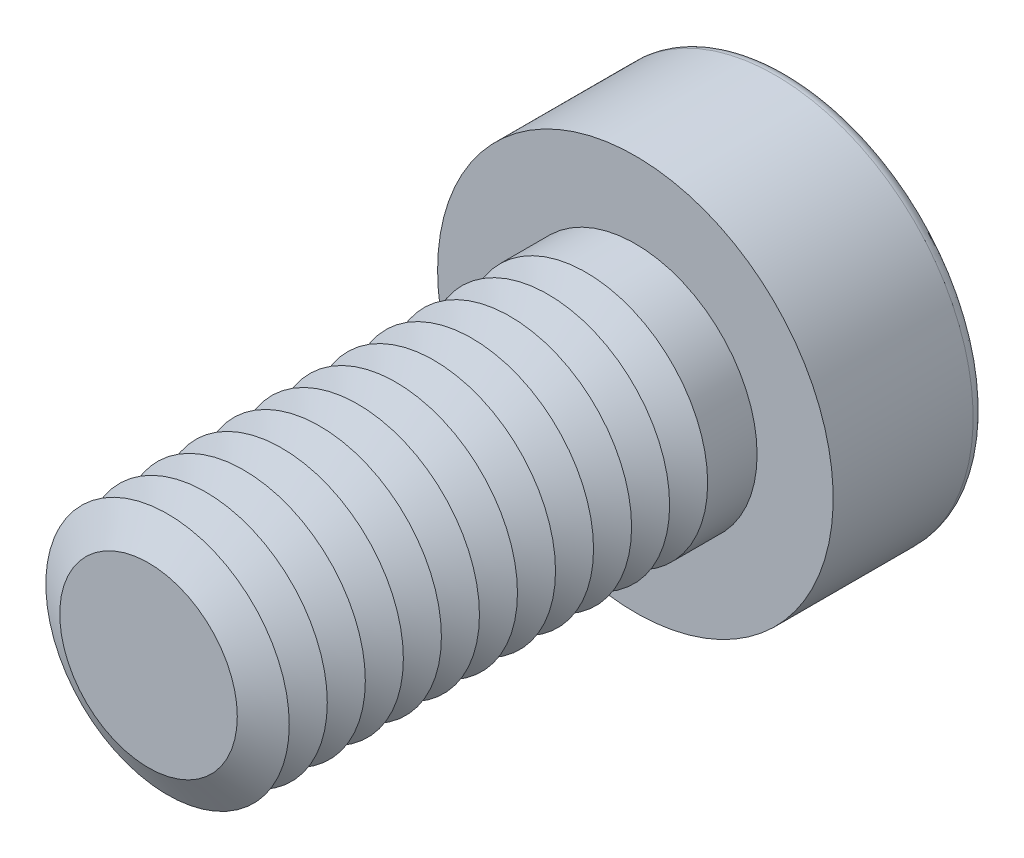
ISO-10303-21;
HEADER;
FILE_DESCRIPTION(('STEP AP214'),'2;1');
FILE_NAME('part.step','',(''),(''),'','','');
FILE_SCHEMA(('AUTOMOTIVE_DESIGN { 1 0 10303 214 1 1 1 1 }'));
ENDSEC;
DATA;
#1=APPLICATION_CONTEXT('core data for automotive mechanical design processes');
#2=APPLICATION_PROTOCOL_DEFINITION('international standard','automotive_design',2000,#1);
#3=PRODUCT_CONTEXT('',#1,'mechanical');
#4=PRODUCT('Part','Part','',(#3));
#5=PRODUCT_RELATED_PRODUCT_CATEGORY('part','',(#4));
#6=PRODUCT_DEFINITION_FORMATION('','',#4);
#7=PRODUCT_DEFINITION_CONTEXT('part definition',#1,'design');
#8=PRODUCT_DEFINITION('design','',#6,#7);
#9=PRODUCT_DEFINITION_SHAPE('','',#8);
#10=(LENGTH_UNIT() NAMED_UNIT(*) SI_UNIT(.MILLI.,.METRE.));
#11=(NAMED_UNIT(*) PLANE_ANGLE_UNIT() SI_UNIT($,.RADIAN.));
#12=(NAMED_UNIT(*) SI_UNIT($,.STERADIAN.) SOLID_ANGLE_UNIT());
#13=UNCERTAINTY_MEASURE_WITH_UNIT(LENGTH_MEASURE(1.E-05),#10,'distance_accuracy_value','');
#14=(GEOMETRIC_REPRESENTATION_CONTEXT(3) GLOBAL_UNCERTAINTY_ASSIGNED_CONTEXT((#13)) GLOBAL_UNIT_ASSIGNED_CONTEXT((#10,
#11,#12)) REPRESENTATION_CONTEXT('',''));
#15=CARTESIAN_POINT('',(0.,0.,0.));
#16=DIRECTION('',(0.,0.,1.));
#17=DIRECTION('',(1.,0.,0.));
#18=AXIS2_PLACEMENT_3D('',#15,#16,#17);
#19=CARTESIAN_POINT('',(0.,0.,11.625));
#20=DIRECTION('',(0.,0.,1.));
#21=DIRECTION('',(1.,0.,0.));
#22=AXIS2_PLACEMENT_3D('',#19,#20,#21);
#23=CONICAL_SURFACE('',#22,4.,1.0471975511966);
#24=CARTESIAN_POINT('',(0.,0.,11.));
#25=DIRECTION('',(0.,0.,1.));
#26=DIRECTION('',(1.,0.,0.));
#27=AXIS2_PLACEMENT_3D('',#24,#25,#26);
#28=CIRCLE('',#27,2.91746824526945);
#29=CARTESIAN_POINT('',(2.91746824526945,0.,11.));
#30=VERTEX_POINT('',#29);
#31=EDGE_CURVE('E313',#30,#30,#28,.T.);
#32=ORIENTED_EDGE('',*,*,#31,.T.);
#33=EDGE_LOOP('',(#32));
#34=FACE_BOUND('',#33,.T.);
#35=CARTESIAN_POINT('',(0.,0.,11.625));
#36=DIRECTION('',(0.,0.,1.));
#37=DIRECTION('',(1.,0.,0.));
#38=AXIS2_PLACEMENT_3D('',#35,#36,#37);
#39=CIRCLE('',#38,4.);
#40=CARTESIAN_POINT('',(4.,0.,11.625));
#41=VERTEX_POINT('',#40);
#42=EDGE_CURVE('E316',#41,#41,#39,.T.);
#43=ORIENTED_EDGE('',*,*,#42,.F.);
#44=EDGE_LOOP('',(#43));
#45=FACE_BOUND('',#44,.T.);
#46=ADVANCED_FACE('F39',(#34,#45),#23,.T.);
#47=CARTESIAN_POINT('',(0.,0.,11.));
#48=DIRECTION('',(0.,0.,-1.));
#49=DIRECTION('',(-1.,0.,0.));
#50=AXIS2_PLACEMENT_3D('',#47,#48,#49);
#51=CONICAL_SURFACE('',#50,2.91746824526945,1.0471975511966);
#52=CARTESIAN_POINT('',(0.,0.,10.375));
#53=DIRECTION('',(0.,0.,1.));
#54=DIRECTION('',(1.,0.,0.));
#55=AXIS2_PLACEMENT_3D('',#52,#53,#54);
#56=CIRCLE('',#55,4.);
#57=CARTESIAN_POINT('',(4.,0.,10.375));
#58=VERTEX_POINT('',#57);
#59=EDGE_CURVE('E324',#58,#58,#56,.T.);
#60=ORIENTED_EDGE('',*,*,#59,.T.);
#61=EDGE_LOOP('',(#60));
#62=FACE_BOUND('',#61,.T.);
#63=ORIENTED_EDGE('',*,*,#31,.F.);
#64=EDGE_LOOP('',(#63));
#65=FACE_BOUND('',#64,.T.);
#66=ADVANCED_FACE('F245',(#62,#65),#51,.T.);
#67=CARTESIAN_POINT('',(0.,0.,16.));
#68=DIRECTION('',(0.,0.,1.));
#69=DIRECTION('',(1.,0.,0.));
#70=AXIS2_PLACEMENT_3D('',#67,#68,#69);
#71=PLANE('',#70);
#72=CARTESIAN_POINT('',(0.,0.,16.));
#73=DIRECTION('',(0.,0.,1.));
#74=DIRECTION('',(1.,0.,0.));
#75=AXIS2_PLACEMENT_3D('',#72,#73,#74);
#76=CIRCLE('',#75,2.91746824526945);
#77=CARTESIAN_POINT('',(2.91746824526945,0.,16.));
#78=VERTEX_POINT('',#77);
#79=EDGE_CURVE('E174',#78,#78,#76,.T.);
#80=ORIENTED_EDGE('',*,*,#79,.T.);
#81=EDGE_LOOP('',(#80));
#82=FACE_BOUND('',#81,.T.);
#83=ADVANCED_FACE('F251',(#82),#71,.T.);
#84=CARTESIAN_POINT('',(0.,0.,16.));
#85=DIRECTION('',(0.,0.,-1.));
#86=DIRECTION('',(-1.,0.,0.));
#87=AXIS2_PLACEMENT_3D('',#84,#85,#86);
#88=CONICAL_SURFACE('',#87,2.91746824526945,1.0471975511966);
#89=CARTESIAN_POINT('',(0.,0.,15.375));
#90=DIRECTION('',(0.,0.,1.));
#91=DIRECTION('',(1.,0.,0.));
#92=AXIS2_PLACEMENT_3D('',#89,#90,#91);
#93=CIRCLE('',#92,4.);
#94=CARTESIAN_POINT('',(4.,0.,15.375));
#95=VERTEX_POINT('',#94);
#96=EDGE_CURVE('E291',#95,#95,#93,.T.);
#97=ORIENTED_EDGE('',*,*,#96,.T.);
#98=EDGE_LOOP('',(#97));
#99=FACE_BOUND('',#98,.T.);
#100=ORIENTED_EDGE('',*,*,#79,.F.);
#101=EDGE_LOOP('',(#100));
#102=FACE_BOUND('',#101,.T.);
#103=ADVANCED_FACE('F199',(#99,#102),#88,.T.);
#104=CARTESIAN_POINT('',(0.,0.,15.375));
#105=DIRECTION('',(0.,0.,1.));
#106=DIRECTION('',(1.,0.,0.));
#107=AXIS2_PLACEMENT_3D('',#104,#105,#106);
#108=CONICAL_SURFACE('',#107,4.,1.0471975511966);
#109=CARTESIAN_POINT('',(0.,0.,14.75));
#110=DIRECTION('',(0.,0.,1.));
#111=DIRECTION('',(1.,0.,0.));
#112=AXIS2_PLACEMENT_3D('',#109,#110,#111);
#113=CIRCLE('',#112,2.91746824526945);
#114=CARTESIAN_POINT('',(2.91746824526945,0.,14.75));
#115=VERTEX_POINT('',#114);
#116=EDGE_CURVE('E288',#115,#115,#113,.T.);
#117=ORIENTED_EDGE('',*,*,#116,.T.);
#118=EDGE_LOOP('',(#117));
#119=FACE_BOUND('',#118,.T.);
#120=ORIENTED_EDGE('',*,*,#96,.F.);
#121=EDGE_LOOP('',(#120));
#122=FACE_BOUND('',#121,.T.);
#123=ADVANCED_FACE('F277',(#119,#122),#108,.T.);
#124=CARTESIAN_POINT('',(0.,0.,14.75));
#125=DIRECTION('',(0.,0.,-1.));
#126=DIRECTION('',(-1.,0.,0.));
#127=AXIS2_PLACEMENT_3D('',#124,#125,#126);
#128=CONICAL_SURFACE('',#127,2.91746824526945,1.0471975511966);
#129=CARTESIAN_POINT('',(0.,0.,14.125));
#130=DIRECTION('',(0.,0.,1.));
#131=DIRECTION('',(1.,0.,0.));
#132=AXIS2_PLACEMENT_3D('',#129,#130,#131);
#133=CIRCLE('',#132,4.);
#134=CARTESIAN_POINT('',(4.,0.,14.125));
#135=VERTEX_POINT('',#134);
#136=EDGE_CURVE('E300',#135,#135,#133,.T.);
#137=ORIENTED_EDGE('',*,*,#136,.T.);
#138=EDGE_LOOP('',(#137));
#139=FACE_BOUND('',#138,.T.);
#140=ORIENTED_EDGE('',*,*,#116,.F.);
#141=EDGE_LOOP('',(#140));
#142=FACE_BOUND('',#141,.T.);
#143=ADVANCED_FACE('F274',(#139,#142),#128,.T.);
#144=CARTESIAN_POINT('',(0.,0.,14.125));
#145=DIRECTION('',(0.,0.,1.));
#146=DIRECTION('',(1.,0.,0.));
#147=AXIS2_PLACEMENT_3D('',#144,#145,#146);
#148=CONICAL_SURFACE('',#147,4.,1.0471975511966);
#149=CARTESIAN_POINT('',(0.,0.,13.5));
#150=DIRECTION('',(0.,0.,1.));
#151=DIRECTION('',(1.,0.,0.));
#152=AXIS2_PLACEMENT_3D('',#149,#150,#151);
#153=CIRCLE('',#152,2.91746824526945);
#154=CARTESIAN_POINT('',(2.91746824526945,0.,13.5));
#155=VERTEX_POINT('',#154);
#156=EDGE_CURVE('E293',#155,#155,#153,.T.);
#157=ORIENTED_EDGE('',*,*,#156,.T.);
#158=EDGE_LOOP('',(#157));
#159=FACE_BOUND('',#158,.T.);
#160=ORIENTED_EDGE('',*,*,#136,.F.);
#161=EDGE_LOOP('',(#160));
#162=FACE_BOUND('',#161,.T.);
#163=ADVANCED_FACE('F270',(#159,#162),#148,.T.);
#164=CARTESIAN_POINT('',(0.,0.,13.5));
#165=DIRECTION('',(0.,0.,-1.));
#166=DIRECTION('',(-1.,0.,0.));
#167=AXIS2_PLACEMENT_3D('',#164,#165,#166);
#168=CONICAL_SURFACE('',#167,2.91746824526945,1.0471975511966);
#169=CARTESIAN_POINT('',(0.,0.,12.875));
#170=DIRECTION('',(0.,0.,1.));
#171=DIRECTION('',(1.,0.,0.));
#172=AXIS2_PLACEMENT_3D('',#169,#170,#171);
#173=CIRCLE('',#172,4.);
#174=CARTESIAN_POINT('',(4.,0.,12.875));
#175=VERTEX_POINT('',#174);
#176=EDGE_CURVE('E309',#175,#175,#173,.T.);
#177=ORIENTED_EDGE('',*,*,#176,.T.);
#178=EDGE_LOOP('',(#177));
#179=FACE_BOUND('',#178,.T.);
#180=ORIENTED_EDGE('',*,*,#156,.F.);
#181=EDGE_LOOP('',(#180));
#182=FACE_BOUND('',#181,.T.);
#183=ADVANCED_FACE('F266',(#179,#182),#168,.T.);
#184=CARTESIAN_POINT('',(0.,0.,12.875));
#185=DIRECTION('',(0.,0.,1.));
#186=DIRECTION('',(1.,0.,0.));
#187=AXIS2_PLACEMENT_3D('',#184,#185,#186);
#188=CONICAL_SURFACE('',#187,4.,1.0471975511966);
#189=CARTESIAN_POINT('',(0.,0.,12.25));
#190=DIRECTION('',(0.,0.,1.));
#191=DIRECTION('',(1.,0.,0.));
#192=AXIS2_PLACEMENT_3D('',#189,#190,#191);
#193=CIRCLE('',#192,2.91746824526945);
#194=CARTESIAN_POINT('',(2.91746824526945,0.,12.25));
#195=VERTEX_POINT('',#194);
#196=EDGE_CURVE('E306',#195,#195,#193,.T.);
#197=ORIENTED_EDGE('',*,*,#196,.T.);
#198=EDGE_LOOP('',(#197));
#199=FACE_BOUND('',#198,.T.);
#200=ORIENTED_EDGE('',*,*,#176,.F.);
#201=EDGE_LOOP('',(#200));
#202=FACE_BOUND('',#201,.T.);
#203=ADVANCED_FACE('F262',(#199,#202),#188,.T.);
#204=CARTESIAN_POINT('',(0.,0.,12.25));
#205=DIRECTION('',(0.,0.,-1.));
#206=DIRECTION('',(-1.,0.,0.));
#207=AXIS2_PLACEMENT_3D('',#204,#205,#206);
#208=CONICAL_SURFACE('',#207,2.91746824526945,1.0471975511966);
#209=ORIENTED_EDGE('',*,*,#42,.T.);
#210=EDGE_LOOP('',(#209));
#211=FACE_BOUND('',#210,.T.);
#212=ORIENTED_EDGE('',*,*,#196,.F.);
#213=EDGE_LOOP('',(#212));
#214=FACE_BOUND('',#213,.T.);
#215=ADVANCED_FACE('F258',(#211,#214),#208,.T.);
#216=CARTESIAN_POINT('',(0.,0.,10.375));
#217=DIRECTION('',(0.,0.,1.));
#218=DIRECTION('',(1.,0.,0.));
#219=AXIS2_PLACEMENT_3D('',#216,#217,#218);
#220=CONICAL_SURFACE('',#219,4.,1.0471975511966);
#221=CARTESIAN_POINT('',(0.,0.,9.75));
#222=DIRECTION('',(0.,0.,1.));
#223=DIRECTION('',(1.,0.,0.));
#224=AXIS2_PLACEMENT_3D('',#221,#222,#223);
#225=CIRCLE('',#224,2.91746824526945);
#226=CARTESIAN_POINT('',(2.91746824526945,0.,9.75));
#227=VERTEX_POINT('',#226);
#228=EDGE_CURVE('E320',#227,#227,#225,.T.);
#229=ORIENTED_EDGE('',*,*,#228,.T.);
#230=EDGE_LOOP('',(#229));
#231=FACE_BOUND('',#230,.T.);
#232=ORIENTED_EDGE('',*,*,#59,.F.);
#233=EDGE_LOOP('',(#232));
#234=FACE_BOUND('',#233,.T.);
#235=ADVANCED_FACE('F261',(#231,#234),#220,.T.);
#236=CARTESIAN_POINT('',(0.,0.,9.75));
#237=DIRECTION('',(0.,0.,-1.));
#238=DIRECTION('',(-1.,0.,0.));
#239=AXIS2_PLACEMENT_3D('',#236,#237,#238);
#240=CONICAL_SURFACE('',#239,2.91746824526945,1.0471975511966);
#241=CARTESIAN_POINT('',(0.,0.,9.125));
#242=DIRECTION('',(0.,0.,1.));
#243=DIRECTION('',(1.,0.,0.));
#244=AXIS2_PLACEMENT_3D('',#241,#242,#243);
#245=CIRCLE('',#244,4.);
#246=CARTESIAN_POINT('',(4.,0.,9.125));
#247=VERTEX_POINT('',#246);
#248=EDGE_CURVE('E332',#247,#247,#245,.T.);
#249=ORIENTED_EDGE('',*,*,#248,.T.);
#250=EDGE_LOOP('',(#249));
#251=FACE_BOUND('',#250,.T.);
#252=ORIENTED_EDGE('',*,*,#228,.F.);
#253=EDGE_LOOP('',(#252));
#254=FACE_BOUND('',#253,.T.);
#255=ADVANCED_FACE('F433',(#251,#254),#240,.T.);
#256=CARTESIAN_POINT('',(0.,0.,9.125));
#257=DIRECTION('',(0.,0.,1.));
#258=DIRECTION('',(1.,0.,0.));
#259=AXIS2_PLACEMENT_3D('',#256,#257,#258);
#260=CONICAL_SURFACE('',#259,4.,1.0471975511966);
#261=CARTESIAN_POINT('',(0.,0.,8.5));
#262=DIRECTION('',(0.,0.,1.));
#263=DIRECTION('',(1.,0.,0.));
#264=AXIS2_PLACEMENT_3D('',#261,#262,#263);
#265=CIRCLE('',#264,2.91746824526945);
#266=CARTESIAN_POINT('',(2.91746824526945,0.,8.5));
#267=VERTEX_POINT('',#266);
#268=EDGE_CURVE('E328',#267,#267,#265,.T.);
#269=ORIENTED_EDGE('',*,*,#268,.T.);
#270=EDGE_LOOP('',(#269));
#271=FACE_BOUND('',#270,.T.);
#272=ORIENTED_EDGE('',*,*,#248,.F.);
#273=EDGE_LOOP('',(#272));
#274=FACE_BOUND('',#273,.T.);
#275=ADVANCED_FACE('F429',(#271,#274),#260,.T.);
#276=CARTESIAN_POINT('',(0.,0.,8.5));
#277=DIRECTION('',(0.,0.,-1.));
#278=DIRECTION('',(-1.,0.,0.));
#279=AXIS2_PLACEMENT_3D('',#276,#277,#278);
#280=CONICAL_SURFACE('',#279,2.91746824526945,1.0471975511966);
#281=CARTESIAN_POINT('',(0.,0.,7.875));
#282=DIRECTION('',(0.,0.,1.));
#283=DIRECTION('',(1.,0.,0.));
#284=AXIS2_PLACEMENT_3D('',#281,#282,#283);
#285=CIRCLE('',#284,4.);
#286=CARTESIAN_POINT('',(4.,0.,7.875));
#287=VERTEX_POINT('',#286);
#288=EDGE_CURVE('E340',#287,#287,#285,.T.);
#289=ORIENTED_EDGE('',*,*,#288,.T.);
#290=EDGE_LOOP('',(#289));
#291=FACE_BOUND('',#290,.T.);
#292=ORIENTED_EDGE('',*,*,#268,.F.);
#293=EDGE_LOOP('',(#292));
#294=FACE_BOUND('',#293,.T.);
#295=ADVANCED_FACE('F425',(#291,#294),#280,.T.);
#296=CARTESIAN_POINT('',(0.,0.,7.875));
#297=DIRECTION('',(0.,0.,1.));
#298=DIRECTION('',(1.,0.,0.));
#299=AXIS2_PLACEMENT_3D('',#296,#297,#298);
#300=CONICAL_SURFACE('',#299,4.,1.0471975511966);
#301=CARTESIAN_POINT('',(0.,0.,7.25));
#302=DIRECTION('',(0.,0.,1.));
#303=DIRECTION('',(1.,0.,0.));
#304=AXIS2_PLACEMENT_3D('',#301,#302,#303);
#305=CIRCLE('',#304,2.91746824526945);
#306=CARTESIAN_POINT('',(2.91746824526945,0.,7.25));
#307=VERTEX_POINT('',#306);
#308=EDGE_CURVE('E336',#307,#307,#305,.T.);
#309=ORIENTED_EDGE('',*,*,#308,.T.);
#310=EDGE_LOOP('',(#309));
#311=FACE_BOUND('',#310,.T.);
#312=ORIENTED_EDGE('',*,*,#288,.F.);
#313=EDGE_LOOP('',(#312));
#314=FACE_BOUND('',#313,.T.);
#315=ADVANCED_FACE('F421',(#311,#314),#300,.T.);
#316=CARTESIAN_POINT('',(0.,0.,7.25));
#317=DIRECTION('',(0.,0.,-1.));
#318=DIRECTION('',(-1.,0.,0.));
#319=AXIS2_PLACEMENT_3D('',#316,#317,#318);
#320=CONICAL_SURFACE('',#319,2.91746824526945,1.0471975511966);
#321=CARTESIAN_POINT('',(0.,0.,6.625));
#322=DIRECTION('',(0.,0.,1.));
#323=DIRECTION('',(1.,0.,0.));
#324=AXIS2_PLACEMENT_3D('',#321,#322,#323);
#325=CIRCLE('',#324,4.);
#326=CARTESIAN_POINT('',(4.,0.,6.625));
#327=VERTEX_POINT('',#326);
#328=EDGE_CURVE('E348',#327,#327,#325,.T.);
#329=ORIENTED_EDGE('',*,*,#328,.T.);
#330=EDGE_LOOP('',(#329));
#331=FACE_BOUND('',#330,.T.);
#332=ORIENTED_EDGE('',*,*,#308,.F.);
#333=EDGE_LOOP('',(#332));
#334=FACE_BOUND('',#333,.T.);
#335=ADVANCED_FACE('F417',(#331,#334),#320,.T.);
#336=CARTESIAN_POINT('',(0.,0.,6.625));
#337=DIRECTION('',(0.,0.,1.));
#338=DIRECTION('',(1.,0.,0.));
#339=AXIS2_PLACEMENT_3D('',#336,#337,#338);
#340=CONICAL_SURFACE('',#339,4.,1.0471975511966);
#341=CARTESIAN_POINT('',(0.,0.,6.));
#342=DIRECTION('',(0.,0.,1.));
#343=DIRECTION('',(1.,0.,0.));
#344=AXIS2_PLACEMENT_3D('',#341,#342,#343);
#345=CIRCLE('',#344,2.91746824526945);
#346=CARTESIAN_POINT('',(2.91746824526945,0.,6.));
#347=VERTEX_POINT('',#346);
#348=EDGE_CURVE('E344',#347,#347,#345,.T.);
#349=ORIENTED_EDGE('',*,*,#348,.T.);
#350=EDGE_LOOP('',(#349));
#351=FACE_BOUND('',#350,.T.);
#352=ORIENTED_EDGE('',*,*,#328,.F.);
#353=EDGE_LOOP('',(#352));
#354=FACE_BOUND('',#353,.T.);
#355=ADVANCED_FACE('F413',(#351,#354),#340,.T.);
#356=CARTESIAN_POINT('',(0.,0.,6.));
#357=DIRECTION('',(0.,0.,-1.));
#358=DIRECTION('',(-1.,0.,0.));
#359=AXIS2_PLACEMENT_3D('',#356,#357,#358);
#360=CONICAL_SURFACE('',#359,2.91746824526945,1.0471975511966);
#361=CARTESIAN_POINT('',(0.,0.,5.375));
#362=DIRECTION('',(0.,0.,1.));
#363=DIRECTION('',(1.,0.,0.));
#364=AXIS2_PLACEMENT_3D('',#361,#362,#363);
#365=CIRCLE('',#364,4.);
#366=CARTESIAN_POINT('',(4.,0.,5.375));
#367=VERTEX_POINT('',#366);
#368=EDGE_CURVE('E356',#367,#367,#365,.T.);
#369=ORIENTED_EDGE('',*,*,#368,.T.);
#370=EDGE_LOOP('',(#369));
#371=FACE_BOUND('',#370,.T.);
#372=ORIENTED_EDGE('',*,*,#348,.F.);
#373=EDGE_LOOP('',(#372));
#374=FACE_BOUND('',#373,.T.);
#375=ADVANCED_FACE('F409',(#371,#374),#360,.T.);
#376=CARTESIAN_POINT('',(0.,0.,5.375));
#377=DIRECTION('',(0.,0.,1.));
#378=DIRECTION('',(1.,0.,0.));
#379=AXIS2_PLACEMENT_3D('',#376,#377,#378);
#380=CONICAL_SURFACE('',#379,4.,1.0471975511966);
#381=CARTESIAN_POINT('',(0.,0.,4.75));
#382=DIRECTION('',(0.,0.,1.));
#383=DIRECTION('',(1.,0.,0.));
#384=AXIS2_PLACEMENT_3D('',#381,#382,#383);
#385=CIRCLE('',#384,2.91746824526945);
#386=CARTESIAN_POINT('',(2.91746824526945,0.,4.75));
#387=VERTEX_POINT('',#386);
#388=EDGE_CURVE('E352',#387,#387,#385,.T.);
#389=ORIENTED_EDGE('',*,*,#388,.T.);
#390=EDGE_LOOP('',(#389));
#391=FACE_BOUND('',#390,.T.);
#392=ORIENTED_EDGE('',*,*,#368,.F.);
#393=EDGE_LOOP('',(#392));
#394=FACE_BOUND('',#393,.T.);
#395=ADVANCED_FACE('F405',(#391,#394),#380,.T.);
#396=CARTESIAN_POINT('',(0.,0.,4.75));
#397=DIRECTION('',(0.,0.,-1.));
#398=DIRECTION('',(-1.,0.,0.));
#399=AXIS2_PLACEMENT_3D('',#396,#397,#398);
#400=CONICAL_SURFACE('',#399,2.91746824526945,1.0471975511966);
#401=CARTESIAN_POINT('',(0.,0.,4.125));
#402=DIRECTION('',(0.,0.,1.));
#403=DIRECTION('',(1.,0.,0.));
#404=AXIS2_PLACEMENT_3D('',#401,#402,#403);
#405=CIRCLE('',#404,4.);
#406=CARTESIAN_POINT('',(4.,0.,4.125));
#407=VERTEX_POINT('',#406);
#408=EDGE_CURVE('E364',#407,#407,#405,.T.);
#409=ORIENTED_EDGE('',*,*,#408,.T.);
#410=EDGE_LOOP('',(#409));
#411=FACE_BOUND('',#410,.T.);
#412=ORIENTED_EDGE('',*,*,#388,.F.);
#413=EDGE_LOOP('',(#412));
#414=FACE_BOUND('',#413,.T.);
#415=ADVANCED_FACE('F401',(#411,#414),#400,.T.);
#416=CARTESIAN_POINT('',(0.,0.,4.125));
#417=DIRECTION('',(0.,0.,1.));
#418=DIRECTION('',(1.,0.,0.));
#419=AXIS2_PLACEMENT_3D('',#416,#417,#418);
#420=CONICAL_SURFACE('',#419,4.,1.0471975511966);
#421=CARTESIAN_POINT('',(0.,0.,3.5));
#422=DIRECTION('',(0.,0.,1.));
#423=DIRECTION('',(1.,0.,0.));
#424=AXIS2_PLACEMENT_3D('',#421,#422,#423);
#425=CIRCLE('',#424,2.91746824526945);
#426=CARTESIAN_POINT('',(2.91746824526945,0.,3.5));
#427=VERTEX_POINT('',#426);
#428=EDGE_CURVE('E360',#427,#427,#425,.T.);
#429=ORIENTED_EDGE('',*,*,#428,.T.);
#430=EDGE_LOOP('',(#429));
#431=FACE_BOUND('',#430,.T.);
#432=ORIENTED_EDGE('',*,*,#408,.F.);
#433=EDGE_LOOP('',(#432));
#434=FACE_BOUND('',#433,.T.);
#435=ADVANCED_FACE('F396',(#431,#434),#420,.T.);
#436=CARTESIAN_POINT('',(0.,0.,3.5));
#437=DIRECTION('',(0.,0.,-1.));
#438=DIRECTION('',(-1.,0.,0.));
#439=AXIS2_PLACEMENT_3D('',#436,#437,#438);
#440=CONICAL_SURFACE('',#439,2.91746824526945,1.0471975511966);
#441=CARTESIAN_POINT('',(0.,0.,2.875));
#442=DIRECTION('',(0.,0.,1.));
#443=DIRECTION('',(1.,0.,0.));
#444=AXIS2_PLACEMENT_3D('',#441,#442,#443);
#445=CIRCLE('',#444,4.);
#446=CARTESIAN_POINT('',(4.,0.,2.875));
#447=VERTEX_POINT('',#446);
#448=EDGE_CURVE('E376',#447,#447,#445,.T.);
#449=ORIENTED_EDGE('',*,*,#448,.T.);
#450=EDGE_LOOP('',(#449));
#451=FACE_BOUND('',#450,.T.);
#452=ORIENTED_EDGE('',*,*,#428,.F.);
#453=EDGE_LOOP('',(#452));
#454=FACE_BOUND('',#453,.T.);
#455=ADVANCED_FACE('F382',(#451,#454),#440,.T.);
#456=CARTESIAN_POINT('',(0.,0.,2.875));
#457=DIRECTION('',(0.,0.,1.));
#458=DIRECTION('',(1.,0.,0.));
#459=AXIS2_PLACEMENT_3D('',#456,#457,#458);
#460=CONICAL_SURFACE('',#459,4.,1.0471975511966);
#461=CARTESIAN_POINT('',(0.,0.,2.25));
#462=DIRECTION('',(0.,0.,1.));
#463=DIRECTION('',(1.,0.,0.));
#464=AXIS2_PLACEMENT_3D('',#461,#462,#463);
#465=CIRCLE('',#464,2.91746824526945);
#466=CARTESIAN_POINT('',(2.91746824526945,0.,2.25));
#467=VERTEX_POINT('',#466);
#468=EDGE_CURVE('E368',#467,#467,#465,.T.);
#469=ORIENTED_EDGE('',*,*,#468,.T.);
#470=EDGE_LOOP('',(#469));
#471=FACE_BOUND('',#470,.T.);
#472=ORIENTED_EDGE('',*,*,#448,.F.);
#473=EDGE_LOOP('',(#472));
#474=FACE_BOUND('',#473,.T.);
#475=ADVANCED_FACE('F385',(#471,#474),#460,.T.);
#476=CARTESIAN_POINT('',(0.,0.,2.25));
#477=DIRECTION('',(0.,0.,-1.));
#478=DIRECTION('',(-1.,0.,0.));
#479=AXIS2_PLACEMENT_3D('',#476,#477,#478);
#480=CONICAL_SURFACE('',#479,2.91746824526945,1.0471975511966);
#481=CARTESIAN_POINT('',(0.,0.,1.625));
#482=DIRECTION('',(0.,0.,1.));
#483=DIRECTION('',(1.,0.,0.));
#484=AXIS2_PLACEMENT_3D('',#481,#482,#483);
#485=CIRCLE('',#484,4.);
#486=CARTESIAN_POINT('',(4.,0.,1.625));
#487=VERTEX_POINT('',#486);
#488=EDGE_CURVE('E372',#487,#487,#485,.T.);
#489=ORIENTED_EDGE('',*,*,#488,.T.);
#490=EDGE_LOOP('',(#489));
#491=FACE_BOUND('',#490,.T.);
#492=ORIENTED_EDGE('',*,*,#468,.F.);
#493=EDGE_LOOP('',(#492));
#494=FACE_BOUND('',#493,.T.);
#495=ADVANCED_FACE('F387',(#491,#494),#480,.T.);
#496=CARTESIAN_POINT('',(0.,0.,-1.25));
#497=DIRECTION('',(0.,0.,-1.));
#498=DIRECTION('',(-1.,0.,0.));
#499=AXIS2_PLACEMENT_3D('',#496,#497,#498);
#500=CONICAL_SURFACE('',#499,2.5,1.0471975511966);
#501=CARTESIAN_POINT('',(0.,0.,0.193375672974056));
#502=VERTEX_POINT('',#501);
#503=VERTEX_LOOP('',#502);
#504=FACE_BOUND('',#503,.T.);
#505=CARTESIAN_POINT('',(0.,0.,-1.25));
#506=DIRECTION('',(0.,0.,-1.));
#507=DIRECTION('',(-1.,0.,0.));
#508=AXIS2_PLACEMENT_3D('',#505,#506,#507);
#509=CIRCLE('',#508,2.5);
#510=CARTESIAN_POINT('',(-2.1650635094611,1.25,-1.25));
#511=VERTEX_POINT('',#510);
#512=CARTESIAN_POINT('',(0.,2.5,-1.25));
#513=VERTEX_POINT('',#512);
#514=EDGE_CURVE('E149',#511,#513,#509,.T.);
#515=ORIENTED_EDGE('',*,*,#514,.T.);
#516=CARTESIAN_POINT('',(0.,0.,-1.25));
#517=DIRECTION('',(0.,0.,-1.));
#518=DIRECTION('',(-1.,0.,0.));
#519=AXIS2_PLACEMENT_3D('',#516,#517,#518);
#520=CIRCLE('',#519,2.5);
#521=CARTESIAN_POINT('',(2.1650635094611,1.25,-1.25));
#522=VERTEX_POINT('',#521);
#523=EDGE_CURVE('E54',#513,#522,#520,.T.);
#524=ORIENTED_EDGE('',*,*,#523,.T.);
#525=CARTESIAN_POINT('',(2.1650635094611,-1.25,-1.25));
#526=VERTEX_POINT('',#525);
#527=EDGE_CURVE('E880',#522,#526,#520,.T.);
#528=ORIENTED_EDGE('',*,*,#527,.T.);
#529=CARTESIAN_POINT('',(0.,-2.5,-1.25));
#530=VERTEX_POINT('',#529);
#531=EDGE_CURVE('E878',#526,#530,#520,.T.);
#532=ORIENTED_EDGE('',*,*,#531,.T.);
#533=CARTESIAN_POINT('',(-2.1650635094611,-1.25,-1.25));
#534=VERTEX_POINT('',#533);
#535=EDGE_CURVE('E872',#530,#534,#520,.T.);
#536=ORIENTED_EDGE('',*,*,#535,.T.);
#537=EDGE_CURVE('E870',#534,#511,#520,.T.);
#538=ORIENTED_EDGE('',*,*,#537,.T.);
#539=EDGE_LOOP('',(#515,#524,#528,#532,#536,#538));
#540=FACE_BOUND('',#539,.T.);
#541=ADVANCED_FACE('F201',(#504,#540),#500,.F.);
#542=CARTESIAN_POINT('',(0.,0.,-1.25));
#543=DIRECTION('',(0.,0.,-1.));
#544=DIRECTION('',(-1.,0.,0.));
#545=AXIS2_PLACEMENT_3D('',#542,#543,#544);
#546=PLANE('',#545);
#547=ORIENTED_EDGE('',*,*,#523,.F.);
#548=DIRECTION('',(1.,0.,0.));
#549=VECTOR('',#548,1.);
#550=CARTESIAN_POINT('',(-1.44337567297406,2.5,-1.25));
#551=LINE('',#550,#549);
#552=CARTESIAN_POINT('',(1.44337567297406,2.5,-1.25));
#553=VERTEX_POINT('',#552);
#554=EDGE_CURVE('E917',#513,#553,#551,.T.);
#555=ORIENTED_EDGE('',*,*,#554,.T.);
#556=DIRECTION('',(0.5,-0.866025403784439,0.));
#557=VECTOR('',#556,1.);
#558=CARTESIAN_POINT('',(1.44337567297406,2.5,-1.25));
#559=LINE('',#558,#557);
#560=EDGE_CURVE('E155',#553,#522,#559,.T.);
#561=ORIENTED_EDGE('',*,*,#560,.T.);
#562=EDGE_LOOP('',(#547,#555,#561));
#563=FACE_BOUND('',#562,.T.);
#564=ADVANCED_FACE('F498',(#563),#546,.T.);
#565=ORIENTED_EDGE('',*,*,#527,.F.);
#566=CARTESIAN_POINT('',(2.88675134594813,0.,-1.25));
#567=VERTEX_POINT('',#566);
#568=EDGE_CURVE('E919',#522,#567,#559,.T.);
#569=ORIENTED_EDGE('',*,*,#568,.T.);
#570=DIRECTION('',(-0.5,-0.866025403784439,0.));
#571=VECTOR('',#570,1.);
#572=CARTESIAN_POINT('',(2.88675134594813,0.,-1.25));
#573=LINE('',#572,#571);
#574=EDGE_CURVE('E892',#567,#526,#573,.T.);
#575=ORIENTED_EDGE('',*,*,#574,.T.);
#576=EDGE_LOOP('',(#565,#569,#575));
#577=FACE_BOUND('',#576,.T.);
#578=ADVANCED_FACE('F508',(#577),#546,.T.);
#579=ORIENTED_EDGE('',*,*,#531,.F.);
#580=CARTESIAN_POINT('',(1.44337567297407,-2.5,-1.25));
#581=VERTEX_POINT('',#580);
#582=EDGE_CURVE('E894',#526,#581,#573,.T.);
#583=ORIENTED_EDGE('',*,*,#582,.T.);
#584=DIRECTION('',(-1.,0.,0.));
#585=VECTOR('',#584,1.);
#586=CARTESIAN_POINT('',(1.44337567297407,-2.5,-1.25));
#587=LINE('',#586,#585);
#588=EDGE_CURVE('E845',#581,#530,#587,.T.);
#589=ORIENTED_EDGE('',*,*,#588,.T.);
#590=EDGE_LOOP('',(#579,#583,#589));
#591=FACE_BOUND('',#590,.T.);
#592=ADVANCED_FACE('F518',(#591),#546,.T.);
#593=ORIENTED_EDGE('',*,*,#535,.F.);
#594=CARTESIAN_POINT('',(-1.44337567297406,-2.5,-1.25));
#595=VERTEX_POINT('',#594);
#596=EDGE_CURVE('E889',#530,#595,#587,.T.);
#597=ORIENTED_EDGE('',*,*,#596,.T.);
#598=DIRECTION('',(-0.5,0.866025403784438,0.));
#599=VECTOR('',#598,1.);
#600=CARTESIAN_POINT('',(-1.44337567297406,-2.5,-1.25));
#601=LINE('',#600,#599);
#602=EDGE_CURVE('E891',#595,#534,#601,.T.);
#603=ORIENTED_EDGE('',*,*,#602,.T.);
#604=EDGE_LOOP('',(#593,#597,#603));
#605=FACE_BOUND('',#604,.T.);
#606=ADVANCED_FACE('F526',(#605),#546,.T.);
#607=ORIENTED_EDGE('',*,*,#537,.F.);
#608=CARTESIAN_POINT('',(-2.88675134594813,0.,-1.25));
#609=VERTEX_POINT('',#608);
#610=EDGE_CURVE('E896',#534,#609,#601,.T.);
#611=ORIENTED_EDGE('',*,*,#610,.T.);
#612=DIRECTION('',(0.5,0.866025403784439,0.));
#613=VECTOR('',#612,1.);
#614=CARTESIAN_POINT('',(-2.88675134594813,0.,-1.25));
#615=LINE('',#614,#613);
#616=EDGE_CURVE('E158',#609,#511,#615,.T.);
#617=ORIENTED_EDGE('',*,*,#616,.T.);
#618=EDGE_LOOP('',(#607,#611,#617));
#619=FACE_BOUND('',#618,.T.);
#620=ADVANCED_FACE('F231',(#619),#546,.T.);
#621=ORIENTED_EDGE('',*,*,#514,.F.);
#622=CARTESIAN_POINT('',(-1.44337567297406,2.5,-1.25));
#623=VERTEX_POINT('',#622);
#624=EDGE_CURVE('E903',#511,#623,#615,.T.);
#625=ORIENTED_EDGE('',*,*,#624,.T.);
#626=EDGE_CURVE('E915',#623,#513,#551,.T.);
#627=ORIENTED_EDGE('',*,*,#626,.T.);
#628=EDGE_LOOP('',(#621,#625,#627));
#629=FACE_BOUND('',#628,.T.);
#630=ADVANCED_FACE('F510',(#629),#546,.T.);
#631=CARTESIAN_POINT('',(-1.44337567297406,2.5,-1.25));
#632=DIRECTION('',(0.,1.,0.));
#633=DIRECTION('',(-1.,0.,0.));
#634=AXIS2_PLACEMENT_3D('',#631,#632,#633);
#635=PLANE('',#634);
#636=DIRECTION('',(0.,0.,-1.));
#637=VECTOR('',#636,1.);
#638=CARTESIAN_POINT('',(-1.44337567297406,2.5,-1.25));
#639=LINE('',#638,#637);
#640=CARTESIAN_POINT('',(-1.44337567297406,2.5,-5.));
#641=VERTEX_POINT('',#640);
#642=EDGE_CURVE('E147',#623,#641,#639,.T.);
#643=ORIENTED_EDGE('',*,*,#642,.T.);
#644=CARTESIAN_POINT('',(-3.76800948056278,2.5,-5.43814611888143));
#645=CARTESIAN_POINT('',(-3.65512241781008,2.5,-5.41294788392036));
#646=CARTESIAN_POINT('',(-3.54216337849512,2.5,-5.38806689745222));
#647=CARTESIAN_POINT('',(-3.31606595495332,2.5,-5.33910944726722));
#648=CARTESIAN_POINT('',(-3.202927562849,2.5,-5.31503301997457));
#649=CARTESIAN_POINT('',(-2.97632910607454,2.5,-5.26783262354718));
#650=CARTESIAN_POINT('',(-2.86286882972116,2.5,-5.24470966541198));
#651=CARTESIAN_POINT('',(-2.63570880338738,2.5,-5.19967851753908));
#652=CARTESIAN_POINT('',(-2.522009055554,2.5,-5.17777031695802));
#653=CARTESIAN_POINT('',(-2.18246936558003,2.5,-5.11464083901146));
#654=CARTESIAN_POINT('',(-1.95621666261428,2.5,-5.07559469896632));
#655=CARTESIAN_POINT('',(-1.50233128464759,2.5,-5.00642421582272));
#656=CARTESIAN_POINT('',(-1.27469889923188,2.5,-4.97629806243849));
#657=CARTESIAN_POINT('',(-0.930935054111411,2.5,-4.9407375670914));
#658=CARTESIAN_POINT('',(-0.815306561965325,2.5,-4.93045885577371));
#659=CARTESIAN_POINT('',(-0.583775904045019,2.5,-4.91374261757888));
#660=CARTESIAN_POINT('',(-0.467873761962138,2.5,-4.9073047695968));
#661=CARTESIAN_POINT('',(-0.235955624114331,2.5,-4.89864425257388));
#662=CARTESIAN_POINT('',(-0.119939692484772,2.5,-4.89641989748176));
#663=CARTESIAN_POINT('',(0.11209426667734,2.5,-4.89632233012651));
#664=CARTESIAN_POINT('',(0.228112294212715,2.5,-4.89844912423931));
#665=CARTESIAN_POINT('',(0.460464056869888,2.5,-4.90693624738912));
#666=CARTESIAN_POINT('',(0.576797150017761,2.5,-4.91331380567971));
#667=CARTESIAN_POINT('',(0.809186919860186,2.5,-4.92994602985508));
#668=CARTESIAN_POINT('',(0.925243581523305,2.5,-4.94020090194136));
#669=CARTESIAN_POINT('',(1.1570783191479,2.5,-4.96408095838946));
#670=CARTESIAN_POINT('',(1.27285617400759,2.5,-4.97770825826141));
#671=CARTESIAN_POINT('',(1.50403978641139,2.5,-5.0077859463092));
#672=CARTESIAN_POINT('',(1.61944554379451,2.5,-5.02423633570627));
#673=CARTESIAN_POINT('',(1.97116037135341,2.5,-5.07794848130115));
#674=CARTESIAN_POINT('',(2.20690405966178,2.5,-5.11889404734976));
#675=CARTESIAN_POINT('',(2.67723558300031,2.5,-5.2069642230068));
#676=CARTESIAN_POINT('',(2.9118232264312,2.5,-5.25408982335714));
#677=CARTESIAN_POINT('',(3.38022088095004,2.5,-5.35235327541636));
#678=CARTESIAN_POINT('',(3.61403064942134,2.5,-5.40349227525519));
#679=CARTESIAN_POINT('',(4.08105387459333,2.5,-5.50842823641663));
#680=CARTESIAN_POINT('',(4.31426731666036,2.5,-5.56222526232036));
#681=CARTESIAN_POINT('',(4.77742011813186,2.5,-5.67097662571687));
#682=CARTESIAN_POINT('',(5.00736469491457,2.5,-5.72590882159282));
#683=CARTESIAN_POINT('',(5.46695141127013,2.5,-5.83704335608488));
#684=CARTESIAN_POINT('',(5.69659354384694,2.5,-5.89324572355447));
#685=CARTESIAN_POINT('',(6.15532898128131,2.5,-6.00649703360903));
#686=CARTESIAN_POINT('',(6.3844226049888,2.5,-6.06354468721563));
#687=CARTESIAN_POINT('',(6.84242442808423,2.5,-6.17834514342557));
#688=CARTESIAN_POINT('',(7.07133263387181,2.5,-6.23609792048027));
#689=CARTESIAN_POINT('',(7.30017784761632,2.5,-6.29409642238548));
#690=B_SPLINE_CURVE_WITH_KNOTS('',3,(#644,#645,#646,#647,#648,#649,#650,#651,#652,#653,#654,
#655,#656,#657,#658,#659,#660,#661,#662,#663,#664,#665,#666,#667,#668,#669,#670,#671,#672,#673,
#674,#675,#676,#677,#678,#679,#680,#681,#682,#683,#684,#685,#686,#687,#688,#689),.UNSPECIFIED.,
.F.,.F.,(4,2,2,2,2,2,2,2,2,2,2,2,2,2,2,2,2,2,2,2,2,2,4),(0.,0.346996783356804,0.694009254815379,
1.04138068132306,1.38874900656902,2.07743762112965,2.76598637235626,3.11418615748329,
3.46235682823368,3.81038814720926,4.15841997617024,4.50787110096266,4.85734081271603,
5.2070303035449,5.55671994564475,6.27438533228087,6.99216591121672,7.71015258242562,
8.42815670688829,9.13739674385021,9.84665290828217,10.5549206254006,11.2631627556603),.UNSPECIFIED.);
#691=CARTESIAN_POINT('',(1.44337567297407,2.5,-5.));
#692=VERTEX_POINT('',#691);
#693=EDGE_CURVE('E124',#641,#692,#690,.T.);
#694=ORIENTED_EDGE('',*,*,#693,.T.);
#695=DIRECTION('',(0.,0.,-1.));
#696=VECTOR('',#695,1.);
#697=CARTESIAN_POINT('',(1.44337567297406,2.5,-1.25));
#698=LINE('',#697,#696);
#699=EDGE_CURVE('E143',#553,#692,#698,.T.);
#700=ORIENTED_EDGE('',*,*,#699,.F.);
#701=ORIENTED_EDGE('',*,*,#554,.F.);
#702=ORIENTED_EDGE('',*,*,#626,.F.);
#703=EDGE_LOOP('',(#643,#694,#700,#701,#702));
#704=FACE_BOUND('',#703,.T.);
#705=ADVANCED_FACE('F141',(#704),#635,.F.);
#706=CARTESIAN_POINT('',(1.44337567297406,2.5,-1.25));
#707=DIRECTION('',(0.866025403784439,0.5,0.));
#708=DIRECTION('',(-0.5,0.866025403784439,0.));
#709=AXIS2_PLACEMENT_3D('',#706,#707,#708);
#710=PLANE('',#709);
#711=ORIENTED_EDGE('',*,*,#699,.T.);
#712=CARTESIAN_POINT('',(1.44326020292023,2.5002,-5.00003094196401));
#713=CARTESIAN_POINT('',(1.50320952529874,2.3963647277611,-4.98395956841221));
#714=CARTESIAN_POINT('',(1.56326755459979,2.29234116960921,-4.96936932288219));
#715=CARTESIAN_POINT('',(1.68359574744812,2.08392662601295,-4.94373552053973));
#716=CARTESIAN_POINT('',(1.7438659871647,1.97953550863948,-4.93269340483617));
#717=CARTESIAN_POINT('',(1.86425311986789,1.77101887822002,-4.91480059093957));
#718=CARTESIAN_POINT('',(1.9243691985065,1.66689477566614,-4.90792855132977));
#719=CARTESIAN_POINT('',(2.04467803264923,1.45851376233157,-4.89871383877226));
#720=CARTESIAN_POINT('',(2.10487077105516,1.35425688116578,-4.89637028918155));
#721=CARTESIAN_POINT('',(2.22525624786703,1.14574311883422,-4.89637028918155));
#722=CARTESIAN_POINT('',(2.28544898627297,1.04148623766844,-4.89871383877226));
#723=CARTESIAN_POINT('',(2.40575782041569,0.833105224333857,-4.90792855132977));
#724=CARTESIAN_POINT('',(2.4658738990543,0.728981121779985,-4.91480059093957));
#725=CARTESIAN_POINT('',(2.58626103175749,0.520464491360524,-4.93269340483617));
#726=CARTESIAN_POINT('',(2.64653127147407,0.416073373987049,-4.94373552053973));
#727=CARTESIAN_POINT('',(2.7668594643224,0.207658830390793,-4.96936932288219));
#728=CARTESIAN_POINT('',(2.82691749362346,0.103635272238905,-4.98395956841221));
#729=CARTESIAN_POINT('',(2.88686681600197,-0.000199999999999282,-5.00003094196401));
#730=B_SPLINE_CURVE_WITH_KNOTS('',3,(#712,#713,#714,#715,#716,#717,#718,#719,#720,#721,#722,
#723,#724,#725,#726,#727,#728,#729),.UNSPECIFIED.,.F.,.F.,(4,2,2,2,2,2,2,2,4),(0.,
0.362931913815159,0.726011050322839,1.08721601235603,1.44835104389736,1.80948607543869,
2.17069103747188,2.53377017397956,2.89670208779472),.UNSPECIFIED.);
#731=CARTESIAN_POINT('',(2.88675134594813,0.,-5.));
#732=VERTEX_POINT('',#731);
#733=EDGE_CURVE('E11',#692,#732,#730,.T.);
#734=ORIENTED_EDGE('',*,*,#733,.T.);
#735=DIRECTION('',(0.,0.,-1.));
#736=VECTOR('',#735,1.);
#737=CARTESIAN_POINT('',(2.88675134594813,0.,-1.25));
#738=LINE('',#737,#736);
#739=EDGE_CURVE('E157',#567,#732,#738,.T.);
#740=ORIENTED_EDGE('',*,*,#739,.F.);
#741=ORIENTED_EDGE('',*,*,#568,.F.);
#742=ORIENTED_EDGE('',*,*,#560,.F.);
#743=EDGE_LOOP('',(#711,#734,#740,#741,#742));
#744=FACE_BOUND('',#743,.T.);
#745=ADVANCED_FACE('F152',(#744),#710,.F.);
#746=CARTESIAN_POINT('',(2.88675134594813,0.,-1.25));
#747=DIRECTION('',(0.866025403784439,-0.5,0.));
#748=DIRECTION('',(0.5,0.866025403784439,0.));
#749=AXIS2_PLACEMENT_3D('',#746,#747,#748);
#750=PLANE('',#749);
#751=ORIENTED_EDGE('',*,*,#739,.T.);
#752=CARTESIAN_POINT('',(2.88686681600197,0.000200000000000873,-5.00003094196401));
#753=CARTESIAN_POINT('',(2.82691749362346,-0.103635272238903,-4.98395956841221));
#754=CARTESIAN_POINT('',(2.7668594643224,-0.207658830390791,-4.96936932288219));
#755=CARTESIAN_POINT('',(2.64653127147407,-0.416073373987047,-4.94373552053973));
#756=CARTESIAN_POINT('',(2.58626103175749,-0.520464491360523,-4.93269340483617));
#757=CARTESIAN_POINT('',(2.4658738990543,-0.728981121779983,-4.91480059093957));
#758=CARTESIAN_POINT('',(2.40575782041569,-0.833105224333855,-4.90792855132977));
#759=CARTESIAN_POINT('',(2.28544898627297,-1.04148623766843,-4.89871383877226));
#760=CARTESIAN_POINT('',(2.22525624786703,-1.14574311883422,-4.89637028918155));
#761=CARTESIAN_POINT('',(2.10487077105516,-1.35425688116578,-4.89637028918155));
#762=CARTESIAN_POINT('',(2.04467803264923,-1.45851376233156,-4.89871383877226));
#763=CARTESIAN_POINT('',(1.9243691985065,-1.66689477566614,-4.90792855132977));
#764=CARTESIAN_POINT('',(1.86425311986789,-1.77101887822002,-4.91480059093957));
#765=CARTESIAN_POINT('',(1.74386598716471,-1.97953550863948,-4.93269340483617));
#766=CARTESIAN_POINT('',(1.68359574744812,-2.08392662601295,-4.94373552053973));
#767=CARTESIAN_POINT('',(1.56326755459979,-2.29234116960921,-4.96936932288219));
#768=CARTESIAN_POINT('',(1.50320952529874,-2.3963647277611,-4.98395956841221));
#769=CARTESIAN_POINT('',(1.44326020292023,-2.5002,-5.00003094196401));
#770=B_SPLINE_CURVE_WITH_KNOTS('',3,(#752,#753,#754,#755,#756,#757,#758,#759,#760,#761,#762,
#763,#764,#765,#766,#767,#768,#769),.UNSPECIFIED.,.F.,.F.,(4,2,2,2,2,2,2,2,4),(0.,
0.362931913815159,0.726011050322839,1.08721601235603,1.44835104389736,1.80948607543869,
2.17069103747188,2.53377017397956,2.89670208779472),.UNSPECIFIED.);
#771=CARTESIAN_POINT('',(1.44337567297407,-2.5,-5.));
#772=VERTEX_POINT('',#771);
#773=EDGE_CURVE('E173',#732,#772,#770,.T.);
#774=ORIENTED_EDGE('',*,*,#773,.T.);
#775=DIRECTION('',(0.,0.,-1.));
#776=VECTOR('',#775,1.);
#777=CARTESIAN_POINT('',(1.44337567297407,-2.5,-1.25));
#778=LINE('',#777,#776);
#779=EDGE_CURVE('E840',#581,#772,#778,.T.);
#780=ORIENTED_EDGE('',*,*,#779,.F.);
#781=ORIENTED_EDGE('',*,*,#582,.F.);
#782=ORIENTED_EDGE('',*,*,#574,.F.);
#783=EDGE_LOOP('',(#751,#774,#780,#781,#782));
#784=FACE_BOUND('',#783,.T.);
#785=ADVANCED_FACE('F191',(#784),#750,.F.);
#786=CARTESIAN_POINT('',(1.44337567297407,-2.5,-1.25));
#787=DIRECTION('',(0.,-1.,0.));
#788=DIRECTION('',(1.,0.,0.));
#789=AXIS2_PLACEMENT_3D('',#786,#787,#788);
#790=PLANE('',#789);
#791=ORIENTED_EDGE('',*,*,#779,.T.);
#792=CARTESIAN_POINT('',(-3.76800948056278,-2.5,-5.43814611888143));
#793=CARTESIAN_POINT('',(-3.65512241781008,-2.5,-5.41294788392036));
#794=CARTESIAN_POINT('',(-3.54216337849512,-2.5,-5.38806689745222));
#795=CARTESIAN_POINT('',(-3.31606595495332,-2.5,-5.33910944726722));
#796=CARTESIAN_POINT('',(-3.202927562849,-2.5,-5.31503301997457));
#797=CARTESIAN_POINT('',(-2.97632910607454,-2.5,-5.26783262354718));
#798=CARTESIAN_POINT('',(-2.86286882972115,-2.5,-5.24470966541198));
#799=CARTESIAN_POINT('',(-2.63570880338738,-2.5,-5.19967851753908));
#800=CARTESIAN_POINT('',(-2.522009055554,-2.5,-5.17777031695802));
#801=CARTESIAN_POINT('',(-2.18246936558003,-2.5,-5.11464083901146));
#802=CARTESIAN_POINT('',(-1.95621666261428,-2.5,-5.07559469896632));
#803=CARTESIAN_POINT('',(-1.50233128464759,-2.5,-5.00642421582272));
#804=CARTESIAN_POINT('',(-1.27469889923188,-2.5,-4.97629806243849));
#805=CARTESIAN_POINT('',(-0.930935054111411,-2.5,-4.9407375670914));
#806=CARTESIAN_POINT('',(-0.815306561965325,-2.5,-4.93045885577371));
#807=CARTESIAN_POINT('',(-0.583775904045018,-2.5,-4.91374261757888));
#808=CARTESIAN_POINT('',(-0.467873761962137,-2.5,-4.9073047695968));
#809=CARTESIAN_POINT('',(-0.23595562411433,-2.5,-4.89864425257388));
#810=CARTESIAN_POINT('',(-0.119939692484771,-2.5,-4.89641989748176));
#811=CARTESIAN_POINT('',(0.112094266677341,-2.5,-4.89632233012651));
#812=CARTESIAN_POINT('',(0.228112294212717,-2.5,-4.89844912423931));
#813=CARTESIAN_POINT('',(0.460464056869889,-2.5,-4.90693624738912));
#814=CARTESIAN_POINT('',(0.576797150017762,-2.5,-4.91331380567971));
#815=CARTESIAN_POINT('',(0.809186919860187,-2.5,-4.92994602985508));
#816=CARTESIAN_POINT('',(0.925243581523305,-2.5,-4.94020090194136));
#817=CARTESIAN_POINT('',(1.1570783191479,-2.5,-4.96408095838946));
#818=CARTESIAN_POINT('',(1.27285617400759,-2.5,-4.97770825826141));
#819=CARTESIAN_POINT('',(1.50403978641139,-2.5,-5.0077859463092));
#820=CARTESIAN_POINT('',(1.61944554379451,-2.5,-5.02423633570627));
#821=CARTESIAN_POINT('',(1.97116037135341,-2.5,-5.07794848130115));
#822=CARTESIAN_POINT('',(2.20690405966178,-2.5,-5.11889404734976));
#823=CARTESIAN_POINT('',(2.67723558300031,-2.5,-5.2069642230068));
#824=CARTESIAN_POINT('',(2.9118232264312,-2.5,-5.25408982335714));
#825=CARTESIAN_POINT('',(3.38022088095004,-2.5,-5.35235327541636));
#826=CARTESIAN_POINT('',(3.61403064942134,-2.5,-5.40349227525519));
#827=CARTESIAN_POINT('',(4.08105387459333,-2.5,-5.50842823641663));
#828=CARTESIAN_POINT('',(4.31426731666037,-2.5,-5.56222526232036));
#829=CARTESIAN_POINT('',(4.77742011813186,-2.5,-5.67097662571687));
#830=CARTESIAN_POINT('',(5.00736469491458,-2.5,-5.72590882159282));
#831=CARTESIAN_POINT('',(5.46695141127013,-2.5,-5.83704335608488));
#832=CARTESIAN_POINT('',(5.69659354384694,-2.5,-5.89324572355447));
#833=CARTESIAN_POINT('',(6.15532898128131,-2.5,-6.00649703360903));
#834=CARTESIAN_POINT('',(6.38442260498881,-2.5,-6.06354468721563));
#835=CARTESIAN_POINT('',(6.84242442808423,-2.5,-6.17834514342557));
#836=CARTESIAN_POINT('',(7.07133263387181,-2.5,-6.23609792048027));
#837=CARTESIAN_POINT('',(7.30017784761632,-2.5,-6.29409642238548));
#838=B_SPLINE_CURVE_WITH_KNOTS('',3,(#792,#793,#794,#795,#796,#797,#798,#799,#800,#801,#802,
#803,#804,#805,#806,#807,#808,#809,#810,#811,#812,#813,#814,#815,#816,#817,#818,#819,#820,#821,
#822,#823,#824,#825,#826,#827,#828,#829,#830,#831,#832,#833,#834,#835,#836,#837),.UNSPECIFIED.,
.F.,.F.,(4,2,2,2,2,2,2,2,2,2,2,2,2,2,2,2,2,2,2,2,2,2,4),(0.,0.346996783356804,0.69400925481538,
1.04138068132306,1.38874900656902,2.07743762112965,2.76598637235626,3.11418615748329,
3.46235682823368,3.81038814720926,4.15841997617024,4.50787110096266,4.85734081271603,
5.20703030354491,5.55671994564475,6.27438533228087,6.99216591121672,7.71015258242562,
8.42815670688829,9.13739674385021,9.84665290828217,10.5549206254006,11.2631627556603),.UNSPECIFIED.);
#839=CARTESIAN_POINT('',(-1.44337567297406,-2.5,-5.));
#840=VERTEX_POINT('',#839);
#841=EDGE_CURVE('E184',#772,#840,#838,.F.);
#842=ORIENTED_EDGE('',*,*,#841,.T.);
#843=DIRECTION('',(0.,0.,-1.));
#844=VECTOR('',#843,1.);
#845=CARTESIAN_POINT('',(-1.44337567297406,-2.5,-1.25));
#846=LINE('',#845,#844);
#847=EDGE_CURVE('E847',#595,#840,#846,.T.);
#848=ORIENTED_EDGE('',*,*,#847,.F.);
#849=ORIENTED_EDGE('',*,*,#596,.F.);
#850=ORIENTED_EDGE('',*,*,#588,.F.);
#851=EDGE_LOOP('',(#791,#842,#848,#849,#850));
#852=FACE_BOUND('',#851,.T.);
#853=ADVANCED_FACE('F234',(#852),#790,.F.);
#854=CARTESIAN_POINT('',(-1.44337567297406,-2.5,-1.25));
#855=DIRECTION('',(-0.866025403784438,-0.5,0.));
#856=DIRECTION('',(0.5,-0.866025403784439,0.));
#857=AXIS2_PLACEMENT_3D('',#854,#855,#856);
#858=PLANE('',#857);
#859=ORIENTED_EDGE('',*,*,#847,.T.);
#860=CARTESIAN_POINT('',(-1.44326020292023,-2.5002,-5.00003094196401));
#861=CARTESIAN_POINT('',(-1.50320952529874,-2.3963647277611,-4.98395956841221));
#862=CARTESIAN_POINT('',(-1.56326755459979,-2.29234116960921,-4.96936932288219));
#863=CARTESIAN_POINT('',(-1.68359574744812,-2.08392662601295,-4.94373552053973));
#864=CARTESIAN_POINT('',(-1.7438659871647,-1.97953550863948,-4.93269340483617));
#865=CARTESIAN_POINT('',(-1.86425311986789,-1.77101887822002,-4.91480059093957));
#866=CARTESIAN_POINT('',(-1.9243691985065,-1.66689477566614,-4.90792855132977));
#867=CARTESIAN_POINT('',(-2.04467803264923,-1.45851376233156,-4.89871383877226));
#868=CARTESIAN_POINT('',(-2.10487077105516,-1.35425688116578,-4.89637028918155));
#869=CARTESIAN_POINT('',(-2.22525624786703,-1.14574311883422,-4.89637028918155));
#870=CARTESIAN_POINT('',(-2.28544898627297,-1.04148623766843,-4.89871383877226));
#871=CARTESIAN_POINT('',(-2.40575782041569,-0.833105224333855,-4.90792855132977));
#872=CARTESIAN_POINT('',(-2.4658738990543,-0.728981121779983,-4.91480059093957));
#873=CARTESIAN_POINT('',(-2.58626103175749,-0.520464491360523,-4.93269340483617));
#874=CARTESIAN_POINT('',(-2.64653127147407,-0.416073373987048,-4.94373552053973));
#875=CARTESIAN_POINT('',(-2.7668594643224,-0.207658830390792,-4.96936932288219));
#876=CARTESIAN_POINT('',(-2.82691749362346,-0.103635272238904,-4.98395956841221));
#877=CARTESIAN_POINT('',(-2.88686681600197,0.000199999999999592,-5.00003094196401));
#878=B_SPLINE_CURVE_WITH_KNOTS('',3,(#860,#861,#862,#863,#864,#865,#866,#867,#868,#869,#870,
#871,#872,#873,#874,#875,#876,#877),.UNSPECIFIED.,.F.,.F.,(4,2,2,2,2,2,2,2,4),(0.,
0.362931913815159,0.726011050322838,1.08721601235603,1.44835104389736,1.80948607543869,
2.17069103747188,2.53377017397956,2.89670208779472),.UNSPECIFIED.);
#879=CARTESIAN_POINT('',(-2.88675134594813,0.,-5.));
#880=VERTEX_POINT('',#879);
#881=EDGE_CURVE('E208',#840,#880,#878,.T.);
#882=ORIENTED_EDGE('',*,*,#881,.T.);
#883=DIRECTION('',(0.,0.,-1.));
#884=VECTOR('',#883,1.);
#885=CARTESIAN_POINT('',(-2.88675134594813,0.,-1.25));
#886=LINE('',#885,#884);
#887=EDGE_CURVE('E850',#609,#880,#886,.T.);
#888=ORIENTED_EDGE('',*,*,#887,.F.);
#889=ORIENTED_EDGE('',*,*,#610,.F.);
#890=ORIENTED_EDGE('',*,*,#602,.F.);
#891=EDGE_LOOP('',(#859,#882,#888,#889,#890));
#892=FACE_BOUND('',#891,.T.);
#893=ADVANCED_FACE('F229',(#892),#858,.F.);
#894=CARTESIAN_POINT('',(-2.88675134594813,0.,-1.25));
#895=DIRECTION('',(-0.866025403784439,0.5,0.));
#896=DIRECTION('',(-0.5,-0.866025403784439,0.));
#897=AXIS2_PLACEMENT_3D('',#894,#895,#896);
#898=PLANE('',#897);
#899=ORIENTED_EDGE('',*,*,#887,.T.);
#900=CARTESIAN_POINT('',(-2.88686681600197,-0.000200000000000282,-5.00003094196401));
#901=CARTESIAN_POINT('',(-2.82691749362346,0.103635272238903,-4.98395956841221));
#902=CARTESIAN_POINT('',(-2.7668594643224,0.207658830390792,-4.96936932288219));
#903=CARTESIAN_POINT('',(-2.64653127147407,0.416073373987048,-4.94373552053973));
#904=CARTESIAN_POINT('',(-2.58626103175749,0.520464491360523,-4.93269340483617));
#905=CARTESIAN_POINT('',(-2.4658738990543,0.728981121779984,-4.91480059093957));
#906=CARTESIAN_POINT('',(-2.40575782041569,0.833105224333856,-4.90792855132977));
#907=CARTESIAN_POINT('',(-2.28544898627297,1.04148623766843,-4.89871383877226));
#908=CARTESIAN_POINT('',(-2.22525624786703,1.14574311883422,-4.89637028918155));
#909=CARTESIAN_POINT('',(-2.10487077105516,1.35425688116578,-4.89637028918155));
#910=CARTESIAN_POINT('',(-2.04467803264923,1.45851376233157,-4.89871383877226));
#911=CARTESIAN_POINT('',(-1.9243691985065,1.66689477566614,-4.90792855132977));
#912=CARTESIAN_POINT('',(-1.86425311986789,1.77101887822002,-4.91480059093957));
#913=CARTESIAN_POINT('',(-1.7438659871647,1.97953550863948,-4.93269340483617));
#914=CARTESIAN_POINT('',(-1.68359574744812,2.08392662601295,-4.94373552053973));
#915=CARTESIAN_POINT('',(-1.56326755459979,2.29234116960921,-4.96936932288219));
#916=CARTESIAN_POINT('',(-1.50320952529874,2.3963647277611,-4.98395956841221));
#917=CARTESIAN_POINT('',(-1.44326020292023,2.5002,-5.00003094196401));
#918=B_SPLINE_CURVE_WITH_KNOTS('',3,(#900,#901,#902,#903,#904,#905,#906,#907,#908,#909,#910,
#911,#912,#913,#914,#915,#916,#917),.UNSPECIFIED.,.F.,.F.,(4,2,2,2,2,2,2,2,4),(0.,
0.362931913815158,0.726011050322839,1.08721601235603,1.44835104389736,1.80948607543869,
2.17069103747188,2.53377017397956,2.89670208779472),.UNSPECIFIED.);
#919=EDGE_CURVE('E150',#880,#641,#918,.T.);
#920=ORIENTED_EDGE('',*,*,#919,.T.);
#921=ORIENTED_EDGE('',*,*,#642,.F.);
#922=ORIENTED_EDGE('',*,*,#624,.F.);
#923=ORIENTED_EDGE('',*,*,#616,.F.);
#924=EDGE_LOOP('',(#899,#920,#921,#922,#923));
#925=FACE_BOUND('',#924,.T.);
#926=ADVANCED_FACE('F197',(#925),#898,.F.);
#927=CARTESIAN_POINT('',(0.,0.,-5.));
#928=DIRECTION('',(0.,0.,-1.));
#929=DIRECTION('',(-1.,0.,0.));
#930=AXIS2_PLACEMENT_3D('',#927,#928,#929);
#931=CONICAL_SURFACE('',#930,2.88675134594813,1.30899693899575);
#932=CARTESIAN_POINT('',(0.,0.,-5.));
#933=DIRECTION('',(0.,0.,-1.));
#934=DIRECTION('',(-1.,0.,0.));
#935=AXIS2_PLACEMENT_3D('',#932,#933,#934);
#936=CIRCLE('',#935,2.88675134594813);
#937=EDGE_CURVE('E120',#641,#692,#936,.T.);
#938=ORIENTED_EDGE('',*,*,#937,.T.);
#939=ORIENTED_EDGE('',*,*,#693,.F.);
#940=EDGE_LOOP('',(#938,#939));
#941=FACE_BOUND('',#940,.T.);
#942=ADVANCED_FACE('F122',(#941),#931,.F.);
#943=EDGE_CURVE('E129',#692,#732,#936,.T.);
#944=ORIENTED_EDGE('',*,*,#943,.T.);
#945=ORIENTED_EDGE('',*,*,#733,.F.);
#946=EDGE_LOOP('',(#944,#945));
#947=FACE_BOUND('',#946,.T.);
#948=ADVANCED_FACE('F133',(#947),#931,.F.);
#949=EDGE_CURVE('E164',#732,#772,#936,.T.);
#950=ORIENTED_EDGE('',*,*,#949,.T.);
#951=ORIENTED_EDGE('',*,*,#773,.F.);
#952=EDGE_LOOP('',(#950,#951));
#953=FACE_BOUND('',#952,.T.);
#954=ADVANCED_FACE('F591',(#953),#931,.F.);
#955=EDGE_CURVE('E169',#772,#840,#936,.T.);
#956=ORIENTED_EDGE('',*,*,#955,.T.);
#957=ORIENTED_EDGE('',*,*,#841,.F.);
#958=EDGE_LOOP('',(#956,#957));
#959=FACE_BOUND('',#958,.T.);
#960=ADVANCED_FACE('F598',(#959),#931,.F.);
#961=EDGE_CURVE('E67',#840,#880,#936,.T.);
#962=ORIENTED_EDGE('',*,*,#961,.T.);
#963=ORIENTED_EDGE('',*,*,#881,.F.);
#964=EDGE_LOOP('',(#962,#963));
#965=FACE_BOUND('',#964,.T.);
#966=ADVANCED_FACE('F606',(#965),#931,.F.);
#967=EDGE_CURVE('E60',#880,#641,#936,.T.);
#968=ORIENTED_EDGE('',*,*,#967,.T.);
#969=ORIENTED_EDGE('',*,*,#919,.F.);
#970=EDGE_LOOP('',(#968,#969));
#971=FACE_BOUND('',#970,.T.);
#972=ADVANCED_FACE('F198',(#971),#931,.F.);
#973=CARTESIAN_POINT('',(0.,0.,-5.));
#974=DIRECTION('',(0.,0.,-1.));
#975=DIRECTION('',(-1.,0.,0.));
#976=AXIS2_PLACEMENT_3D('',#973,#974,#975);
#977=PLANE('',#976);
#978=ORIENTED_EDGE('',*,*,#967,.F.);
#979=ORIENTED_EDGE('',*,*,#961,.F.);
#980=ORIENTED_EDGE('',*,*,#955,.F.);
#981=ORIENTED_EDGE('',*,*,#949,.F.);
#982=ORIENTED_EDGE('',*,*,#943,.F.);
#983=ORIENTED_EDGE('',*,*,#937,.F.);
#984=EDGE_LOOP('',(#978,#979,#980,#981,#982,#983));
#985=FACE_BOUND('',#984,.T.);
#986=CARTESIAN_POINT('',(0.,0.,-5.));
#987=DIRECTION('',(0.,0.,-1.));
#988=DIRECTION('',(-1.,0.,0.));
#989=AXIS2_PLACEMENT_3D('',#986,#987,#988);
#990=CIRCLE('',#989,6.1);
#991=CARTESIAN_POINT('',(-6.1,0.,-5.));
#992=VERTEX_POINT('',#991);
#993=EDGE_CURVE('E864',#992,#992,#990,.T.);
#994=ORIENTED_EDGE('',*,*,#993,.T.);
#995=EDGE_LOOP('',(#994));
#996=FACE_BOUND('',#995,.T.);
#997=ADVANCED_FACE('F161',(#985,#996),#977,.T.);
#998=CARTESIAN_POINT('',(0.,0.,-4.6));
#999=DIRECTION('',(0.,0.,-1.));
#1000=DIRECTION('',(-1.,0.,0.));
#1001=AXIS2_PLACEMENT_3D('',#998,#999,#1000);
#1002=TOROIDAL_SURFACE('',#1001,6.1,0.4);
#1003=CARTESIAN_POINT('',(0.,0.,-4.6));
#1004=DIRECTION('',(0.,0.,-1.));
#1005=DIRECTION('',(-1.,0.,0.));
#1006=AXIS2_PLACEMENT_3D('',#1003,#1004,#1005);
#1007=CIRCLE('',#1006,6.5);
#1008=CARTESIAN_POINT('',(-6.5,0.,-4.6));
#1009=VERTEX_POINT('',#1008);
#1010=EDGE_CURVE('E867',#1009,#1009,#1007,.F.);
#1011=ORIENTED_EDGE('',*,*,#1010,.F.);
#1012=EDGE_LOOP('',(#1011));
#1013=FACE_BOUND('',#1012,.T.);
#1014=ORIENTED_EDGE('',*,*,#993,.F.);
#1015=EDGE_LOOP('',(#1014));
#1016=FACE_BOUND('',#1015,.T.);
#1017=ADVANCED_FACE('F41',(#1013,#1016),#1002,.T.);
#1018=CARTESIAN_POINT('',(0.,0.,-5.));
#1019=DIRECTION('',(0.,0.,1.));
#1020=DIRECTION('',(1.,0.,0.));
#1021=AXIS2_PLACEMENT_3D('',#1018,#1019,#1020);
#1022=CYLINDRICAL_SURFACE('',#1021,6.5);
#1023=ORIENTED_EDGE('',*,*,#1010,.T.);
#1024=EDGE_LOOP('',(#1023));
#1025=FACE_BOUND('',#1024,.T.);
#1026=CARTESIAN_POINT('',(0.,0.,0.));
#1027=DIRECTION('',(0.,0.,-1.));
#1028=DIRECTION('',(-1.,0.,0.));
#1029=AXIS2_PLACEMENT_3D('',#1026,#1027,#1028);
#1030=CIRCLE('',#1029,6.5);
#1031=CARTESIAN_POINT('',(-6.5,0.,0.));
#1032=VERTEX_POINT('',#1031);
#1033=EDGE_CURVE('E856',#1032,#1032,#1030,.T.);
#1034=ORIENTED_EDGE('',*,*,#1033,.T.);
#1035=EDGE_LOOP('',(#1034));
#1036=FACE_BOUND('',#1035,.T.);
#1037=ADVANCED_FACE('F630',(#1025,#1036),#1022,.T.);
#1038=CARTESIAN_POINT('',(0.,0.,0.));
#1039=DIRECTION('',(0.,0.,-1.));
#1040=DIRECTION('',(-1.,0.,0.));
#1041=AXIS2_PLACEMENT_3D('',#1038,#1039,#1040);
#1042=PLANE('',#1041);
#1043=CARTESIAN_POINT('',(0.,0.,0.));
#1044=DIRECTION('',(0.,0.,1.));
#1045=DIRECTION('',(1.,0.,0.));
#1046=AXIS2_PLACEMENT_3D('',#1043,#1044,#1045);
#1047=CIRCLE('',#1046,4.);
#1048=CARTESIAN_POINT('',(4.,0.,0.));
#1049=VERTEX_POINT('',#1048);
#1050=EDGE_CURVE('E860',#1049,#1049,#1047,.T.);
#1051=ORIENTED_EDGE('',*,*,#1050,.F.);
#1052=EDGE_LOOP('',(#1051));
#1053=FACE_BOUND('',#1052,.T.);
#1054=ORIENTED_EDGE('',*,*,#1033,.F.);
#1055=EDGE_LOOP('',(#1054));
#1056=FACE_BOUND('',#1055,.T.);
#1057=ADVANCED_FACE('F638',(#1053,#1056),#1042,.F.);
#1058=CARTESIAN_POINT('',(0.,0.,16.));
#1059=DIRECTION('',(0.,0.,-1.));
#1060=DIRECTION('',(-1.,0.,0.));
#1061=AXIS2_PLACEMENT_3D('',#1058,#1059,#1060);
#1062=CYLINDRICAL_SURFACE('',#1061,4.);
#1063=ORIENTED_EDGE('',*,*,#1050,.T.);
#1064=EDGE_LOOP('',(#1063));
#1065=FACE_BOUND('',#1064,.T.);
#1066=ORIENTED_EDGE('',*,*,#488,.F.);
#1067=EDGE_LOOP('',(#1066));
#1068=FACE_BOUND('',#1067,.T.);
#1069=ADVANCED_FACE('F647',(#1065,#1068),#1062,.T.);
#1070=CLOSED_SHELL('',(#46,#66,#83,#103,#123,#143,#163,#183,#203,#215,#235,#255,#275,#295,#315,
#335,#355,#375,#395,#415,#435,#455,#475,#495,#541,#564,#578,#592,#606,#620,#630,#705,#745,#785,
#853,#893,#926,#942,#948,#954,#960,#966,#972,#997,#1017,#1037,#1057,#1069));
#1071=MANIFOLD_SOLID_BREP('B2',#1070);
#1072=ADVANCED_BREP_SHAPE_REPRESENTATION('',(#18,#1071),#14);
#1073=SHAPE_DEFINITION_REPRESENTATION(#9,#1072);
ENDSEC;
END-ISO-10303-21;
